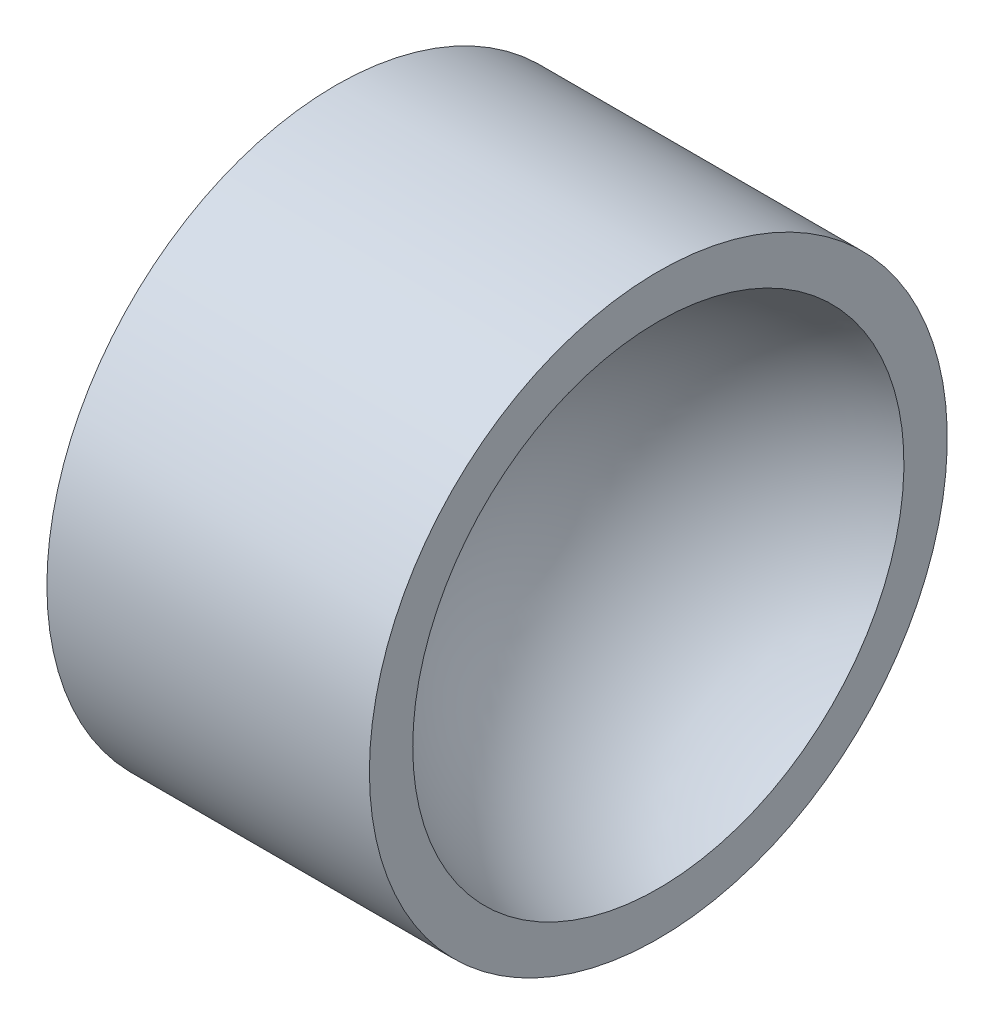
from build123d import *


with BuildPart() as part:
    # Skizze1 → Rotation2 (revolve)
    with BuildSketch(Plane.XY):
        with BuildLine():
            Line((50.695, 0), (52.295, 0))
            ThreePointArc((52.295, 0), (52.640909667, 1.05483851), (53.544294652, 1.7))
            Line((53.544294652, 1.7), (53.544294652, 2))
            Line((53.544294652, 2), (51.311998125, 2))
            ThreePointArc((51.311998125, 2), (50.852754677, 1.046504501), (50.695, 0))
        make_face()
    revolve(axis=Axis((50.695, 0, 0), (1, 0, 0)))


solid = part.part
